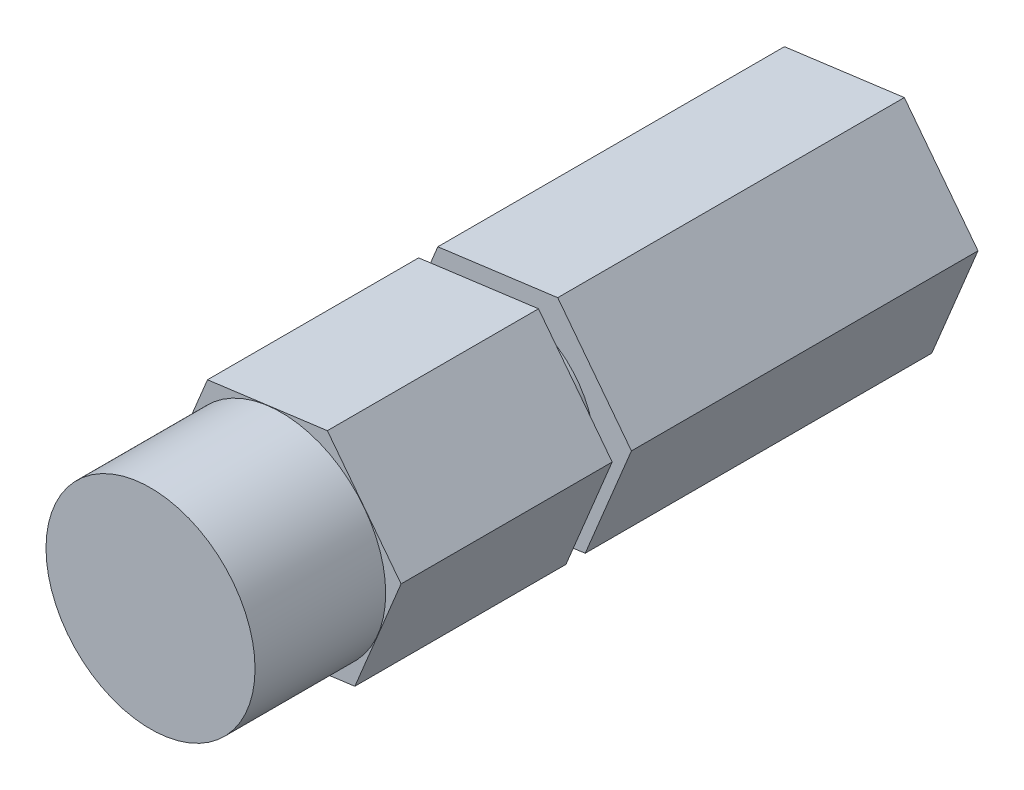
ISO-10303-21;
HEADER;
FILE_DESCRIPTION(('STEP AP214'),'2;1');
FILE_NAME('part.step','',(''),(''),'','','');
FILE_SCHEMA(('AUTOMOTIVE_DESIGN { 1 0 10303 214 1 1 1 1 }'));
ENDSEC;
DATA;
#1=APPLICATION_CONTEXT('core data for automotive mechanical design processes');
#2=APPLICATION_PROTOCOL_DEFINITION('international standard','automotive_design',2000,#1);
#3=PRODUCT_CONTEXT('',#1,'mechanical');
#4=PRODUCT('Part','Part','',(#3));
#5=PRODUCT_RELATED_PRODUCT_CATEGORY('part','',(#4));
#6=PRODUCT_DEFINITION_FORMATION('','',#4);
#7=PRODUCT_DEFINITION_CONTEXT('part definition',#1,'design');
#8=PRODUCT_DEFINITION('design','',#6,#7);
#9=PRODUCT_DEFINITION_SHAPE('','',#8);
#10=(LENGTH_UNIT() NAMED_UNIT(*) SI_UNIT(.MILLI.,.METRE.));
#11=(NAMED_UNIT(*) PLANE_ANGLE_UNIT() SI_UNIT($,.RADIAN.));
#12=(NAMED_UNIT(*) SI_UNIT($,.STERADIAN.) SOLID_ANGLE_UNIT());
#13=UNCERTAINTY_MEASURE_WITH_UNIT(LENGTH_MEASURE(1.E-05),#10,'distance_accuracy_value','');
#14=(GEOMETRIC_REPRESENTATION_CONTEXT(3) GLOBAL_UNCERTAINTY_ASSIGNED_CONTEXT((#13)) GLOBAL_UNIT_ASSIGNED_CONTEXT((#10,
#11,#12)) REPRESENTATION_CONTEXT('',''));
#15=CARTESIAN_POINT('',(0.,0.,0.));
#16=DIRECTION('',(0.,0.,1.));
#17=DIRECTION('',(1.,0.,0.));
#18=AXIS2_PLACEMENT_3D('',#15,#16,#17);
#19=CARTESIAN_POINT('',(7.28353005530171,0.963738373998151,-62.9041538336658));
#20=DIRECTION('',(0.79295528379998,0.609279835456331,0.));
#21=DIRECTION('',(-0.609279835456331,0.79295528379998,0.));
#22=AXIS2_PLACEMENT_3D('',#19,#20,#21);
#23=PLANE('',#22);
#24=DIRECTION('',(-0.609279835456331,0.79295528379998,0.));
#25=VECTOR('',#24,1.);
#26=CARTESIAN_POINT('',(7.28353005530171,0.963738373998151,-21.9329));
#27=LINE('',#26,#25);
#28=CARTESIAN_POINT('',(7.28353005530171,0.963738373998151,-21.9329));
#29=VERTEX_POINT('',#28);
#30=CARTESIAN_POINT('',(2.80714311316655,6.78959124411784,-21.9329));
#31=VERTEX_POINT('',#30);
#32=EDGE_CURVE('E56',#29,#31,#27,.T.);
#33=ORIENTED_EDGE('',*,*,#32,.F.);
#34=DIRECTION('',(0.,0.,1.));
#35=VECTOR('',#34,1.);
#36=CARTESIAN_POINT('',(7.28353005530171,0.963738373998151,-62.9041538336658));
#37=LINE('',#36,#35);
#38=CARTESIAN_POINT('',(7.28353005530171,0.963738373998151,-42.9895));
#39=VERTEX_POINT('',#38);
#40=EDGE_CURVE('E232',#39,#29,#37,.T.);
#41=ORIENTED_EDGE('',*,*,#40,.F.);
#42=DIRECTION('',(0.609279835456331,-0.79295528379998,0.));
#43=VECTOR('',#42,1.);
#44=CARTESIAN_POINT('',(7.28353005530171,0.963738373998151,-42.9895));
#45=LINE('',#44,#43);
#46=CARTESIAN_POINT('',(2.80714311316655,6.78959124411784,-42.9895));
#47=VERTEX_POINT('',#46);
#48=EDGE_CURVE('E186',#47,#39,#45,.T.);
#49=ORIENTED_EDGE('',*,*,#48,.F.);
#50=DIRECTION('',(0.,0.,1.));
#51=VECTOR('',#50,1.);
#52=CARTESIAN_POINT('',(2.80714311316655,6.78959124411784,-62.9041538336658));
#53=LINE('',#52,#51);
#54=EDGE_CURVE('E169',#47,#31,#53,.T.);
#55=ORIENTED_EDGE('',*,*,#54,.T.);
#56=EDGE_LOOP('',(#33,#41,#49,#55));
#57=FACE_BOUND('',#56,.T.);
#58=ADVANCED_FACE('F38',(#57),#23,.T.);
#59=CARTESIAN_POINT('',(4.47638694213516,-5.82585287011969,-62.9041538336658));
#60=DIRECTION('',(0.924129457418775,-0.382079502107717,0.));
#61=DIRECTION('',(0.382079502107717,0.924129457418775,0.));
#62=AXIS2_PLACEMENT_3D('',#59,#60,#61);
#63=PLANE('',#62);
#64=DIRECTION('',(0.382079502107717,0.924129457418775,0.));
#65=VECTOR('',#64,1.);
#66=CARTESIAN_POINT('',(4.47638694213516,-5.82585287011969,-21.9329));
#67=LINE('',#66,#65);
#68=CARTESIAN_POINT('',(4.47638694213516,-5.82585287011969,-21.9329));
#69=VERTEX_POINT('',#68);
#70=EDGE_CURVE('E460',#69,#29,#67,.T.);
#71=ORIENTED_EDGE('',*,*,#70,.F.);
#72=DIRECTION('',(0.,0.,1.));
#73=VECTOR('',#72,1.);
#74=CARTESIAN_POINT('',(4.47638694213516,-5.82585287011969,-62.9041538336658));
#75=LINE('',#74,#73);
#76=CARTESIAN_POINT('',(4.47638694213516,-5.82585287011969,-42.9895));
#77=VERTEX_POINT('',#76);
#78=EDGE_CURVE('E237',#77,#69,#75,.T.);
#79=ORIENTED_EDGE('',*,*,#78,.F.);
#80=DIRECTION('',(-0.382079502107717,-0.924129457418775,0.));
#81=VECTOR('',#80,1.);
#82=CARTESIAN_POINT('',(4.47638694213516,-5.82585287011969,-42.9895));
#83=LINE('',#82,#81);
#84=EDGE_CURVE('E473',#39,#77,#83,.T.);
#85=ORIENTED_EDGE('',*,*,#84,.F.);
#86=ORIENTED_EDGE('',*,*,#40,.T.);
#87=EDGE_LOOP('',(#71,#79,#85,#86));
#88=FACE_BOUND('',#87,.T.);
#89=ADVANCED_FACE('F282',(#88),#63,.T.);
#90=CARTESIAN_POINT('',(-2.80714311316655,-6.78959124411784,-62.9041538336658));
#91=DIRECTION('',(0.131174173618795,-0.991359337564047,0.));
#92=DIRECTION('',(0.991359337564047,0.131174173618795,0.));
#93=AXIS2_PLACEMENT_3D('',#90,#91,#92);
#94=PLANE('',#93);
#95=DIRECTION('',(0.991359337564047,0.131174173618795,0.));
#96=VECTOR('',#95,1.);
#97=CARTESIAN_POINT('',(-2.80714311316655,-6.78959124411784,-21.9329));
#98=LINE('',#97,#96);
#99=CARTESIAN_POINT('',(-2.80714311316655,-6.78959124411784,-21.9329));
#100=VERTEX_POINT('',#99);
#101=EDGE_CURVE('E456',#100,#69,#98,.T.);
#102=ORIENTED_EDGE('',*,*,#101,.F.);
#103=DIRECTION('',(0.,0.,1.));
#104=VECTOR('',#103,1.);
#105=CARTESIAN_POINT('',(-2.80714311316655,-6.78959124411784,-62.9041538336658));
#106=LINE('',#105,#104);
#107=CARTESIAN_POINT('',(-2.80714311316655,-6.78959124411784,-42.9895));
#108=VERTEX_POINT('',#107);
#109=EDGE_CURVE('E242',#108,#100,#106,.T.);
#110=ORIENTED_EDGE('',*,*,#109,.F.);
#111=DIRECTION('',(-0.991359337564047,-0.131174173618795,0.));
#112=VECTOR('',#111,1.);
#113=CARTESIAN_POINT('',(-2.80714311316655,-6.78959124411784,-42.9895));
#114=LINE('',#113,#112);
#115=EDGE_CURVE('E469',#77,#108,#114,.T.);
#116=ORIENTED_EDGE('',*,*,#115,.F.);
#117=ORIENTED_EDGE('',*,*,#78,.T.);
#118=EDGE_LOOP('',(#102,#110,#116,#117));
#119=FACE_BOUND('',#118,.T.);
#120=ADVANCED_FACE('F288',(#119),#94,.T.);
#121=CARTESIAN_POINT('',(-7.28353005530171,-0.963738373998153,-62.9041538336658));
#122=DIRECTION('',(-0.79295528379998,-0.609279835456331,0.));
#123=DIRECTION('',(0.609279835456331,-0.79295528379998,0.));
#124=AXIS2_PLACEMENT_3D('',#121,#122,#123);
#125=PLANE('',#124);
#126=DIRECTION('',(0.609279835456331,-0.79295528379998,0.));
#127=VECTOR('',#126,1.);
#128=CARTESIAN_POINT('',(-7.28353005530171,-0.963738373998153,-21.9329));
#129=LINE('',#128,#127);
#130=CARTESIAN_POINT('',(-7.28353005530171,-0.963738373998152,-21.9329));
#131=VERTEX_POINT('',#130);
#132=EDGE_CURVE('E461',#131,#100,#129,.T.);
#133=ORIENTED_EDGE('',*,*,#132,.F.);
#134=DIRECTION('',(0.,0.,1.));
#135=VECTOR('',#134,1.);
#136=CARTESIAN_POINT('',(-7.28353005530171,-0.963738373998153,-62.9041538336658));
#137=LINE('',#136,#135);
#138=CARTESIAN_POINT('',(-7.28353005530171,-0.963738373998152,-42.9895));
#139=VERTEX_POINT('',#138);
#140=EDGE_CURVE('E245',#139,#131,#137,.T.);
#141=ORIENTED_EDGE('',*,*,#140,.F.);
#142=DIRECTION('',(-0.609279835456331,0.79295528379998,0.));
#143=VECTOR('',#142,1.);
#144=CARTESIAN_POINT('',(-7.28353005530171,-0.963738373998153,-42.9895));
#145=LINE('',#144,#143);
#146=EDGE_CURVE('E465',#108,#139,#145,.T.);
#147=ORIENTED_EDGE('',*,*,#146,.F.);
#148=ORIENTED_EDGE('',*,*,#109,.T.);
#149=EDGE_LOOP('',(#133,#141,#147,#148));
#150=FACE_BOUND('',#149,.T.);
#151=ADVANCED_FACE('F277',(#150),#125,.T.);
#152=CARTESIAN_POINT('',(-4.47638694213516,5.82585287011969,-62.9041538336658));
#153=DIRECTION('',(-0.924129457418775,0.382079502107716,0.));
#154=DIRECTION('',(-0.382079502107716,-0.924129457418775,0.));
#155=AXIS2_PLACEMENT_3D('',#152,#153,#154);
#156=PLANE('',#155);
#157=DIRECTION('',(-0.382079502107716,-0.924129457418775,0.));
#158=VECTOR('',#157,1.);
#159=CARTESIAN_POINT('',(-4.47638694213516,5.82585287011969,-21.9329));
#160=LINE('',#159,#158);
#161=CARTESIAN_POINT('',(-4.47638694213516,5.82585287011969,-21.9329));
#162=VERTEX_POINT('',#161);
#163=EDGE_CURVE('E161',#162,#131,#160,.T.);
#164=ORIENTED_EDGE('',*,*,#163,.F.);
#165=DIRECTION('',(0.,0.,1.));
#166=VECTOR('',#165,1.);
#167=CARTESIAN_POINT('',(-4.47638694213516,5.82585287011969,-62.9041538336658));
#168=LINE('',#167,#166);
#169=CARTESIAN_POINT('',(-4.47638694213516,5.82585287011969,-42.9895));
#170=VERTEX_POINT('',#169);
#171=EDGE_CURVE('E181',#170,#162,#168,.T.);
#172=ORIENTED_EDGE('',*,*,#171,.F.);
#173=DIRECTION('',(0.382079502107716,0.924129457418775,0.));
#174=VECTOR('',#173,1.);
#175=CARTESIAN_POINT('',(-4.47638694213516,5.82585287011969,-42.9895));
#176=LINE('',#175,#174);
#177=EDGE_CURVE('E236',#139,#170,#176,.T.);
#178=ORIENTED_EDGE('',*,*,#177,.F.);
#179=ORIENTED_EDGE('',*,*,#140,.T.);
#180=EDGE_LOOP('',(#164,#172,#178,#179));
#181=FACE_BOUND('',#180,.T.);
#182=ADVANCED_FACE('F269',(#181),#156,.T.);
#183=CARTESIAN_POINT('',(2.80714311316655,6.78959124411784,-62.9041538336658));
#184=DIRECTION('',(-0.131174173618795,0.991359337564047,0.));
#185=DIRECTION('',(-0.991359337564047,-0.131174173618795,0.));
#186=AXIS2_PLACEMENT_3D('',#183,#184,#185);
#187=PLANE('',#186);
#188=DIRECTION('',(-0.991359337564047,-0.131174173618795,0.));
#189=VECTOR('',#188,1.);
#190=CARTESIAN_POINT('',(2.80714311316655,6.78959124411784,-21.9329));
#191=LINE('',#190,#189);
#192=EDGE_CURVE('E11',#31,#162,#191,.T.);
#193=ORIENTED_EDGE('',*,*,#192,.F.);
#194=ORIENTED_EDGE('',*,*,#54,.F.);
#195=DIRECTION('',(0.991359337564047,0.131174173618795,0.));
#196=VECTOR('',#195,1.);
#197=CARTESIAN_POINT('',(2.80714311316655,6.78959124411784,-42.9895));
#198=LINE('',#197,#196);
#199=EDGE_CURVE('E183',#170,#47,#198,.T.);
#200=ORIENTED_EDGE('',*,*,#199,.F.);
#201=ORIENTED_EDGE('',*,*,#171,.T.);
#202=EDGE_LOOP('',(#193,#194,#200,#201));
#203=FACE_BOUND('',#202,.T.);
#204=ADVANCED_FACE('F279',(#203),#187,.T.);
#205=CARTESIAN_POINT('',(0.,6.3627,-42.9895));
#206=DIRECTION('',(0.,0.,1.));
#207=DIRECTION('',(1.,0.,0.));
#208=AXIS2_PLACEMENT_3D('',#205,#206,#207);
#209=PLANE('',#208);
#210=CARTESIAN_POINT('',(0.,0.,-42.9895));
#211=DIRECTION('',(0.,0.,-1.));
#212=DIRECTION('',(-1.,0.,0.));
#213=AXIS2_PLACEMENT_3D('',#210,#211,#212);
#214=CIRCLE('',#213,2.01929999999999);
#215=CARTESIAN_POINT('',(-2.01929999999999,0.,-42.9895));
#216=VERTEX_POINT('',#215);
#217=EDGE_CURVE('E219',#216,#216,#214,.T.);
#218=ORIENTED_EDGE('',*,*,#217,.F.);
#219=EDGE_LOOP('',(#218));
#220=FACE_BOUND('',#219,.T.);
#221=ORIENTED_EDGE('',*,*,#177,.T.);
#222=ORIENTED_EDGE('',*,*,#199,.T.);
#223=ORIENTED_EDGE('',*,*,#48,.T.);
#224=ORIENTED_EDGE('',*,*,#84,.T.);
#225=ORIENTED_EDGE('',*,*,#115,.T.);
#226=ORIENTED_EDGE('',*,*,#146,.T.);
#227=EDGE_LOOP('',(#221,#222,#223,#224,#225,#226));
#228=FACE_BOUND('',#227,.T.);
#229=ADVANCED_FACE('F307',(#220,#228),#209,.F.);
#230=CARTESIAN_POINT('',(0.,0.,-30.2895));
#231=DIRECTION('',(0.,0.,-1.));
#232=DIRECTION('',(-1.,0.,0.));
#233=AXIS2_PLACEMENT_3D('',#230,#231,#232);
#234=CONICAL_SURFACE('',#233,2.0193,1.02974425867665);
#235=CARTESIAN_POINT('',(0.,0.,-29.0761821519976));
#236=VERTEX_POINT('',#235);
#237=VERTEX_LOOP('',#236);
#238=FACE_BOUND('',#237,.T.);
#239=CARTESIAN_POINT('',(0.,0.,-30.2895));
#240=DIRECTION('',(0.,0.,-1.));
#241=DIRECTION('',(-1.,0.,0.));
#242=AXIS2_PLACEMENT_3D('',#239,#240,#241);
#243=CIRCLE('',#242,2.0193);
#244=CARTESIAN_POINT('',(-2.0193,0.,-30.2895));
#245=VERTEX_POINT('',#244);
#246=EDGE_CURVE('E212',#245,#245,#243,.T.);
#247=ORIENTED_EDGE('',*,*,#246,.T.);
#248=EDGE_LOOP('',(#247));
#249=FACE_BOUND('',#248,.T.);
#250=ADVANCED_FACE('F303',(#238,#249),#234,.F.);
#251=CARTESIAN_POINT('',(0.,0.,-42.9895));
#252=DIRECTION('',(0.,0.,-1.));
#253=DIRECTION('',(-1.,0.,0.));
#254=AXIS2_PLACEMENT_3D('',#251,#252,#253);
#255=CYLINDRICAL_SURFACE('',#254,2.01929999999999);
#256=ORIENTED_EDGE('',*,*,#246,.F.);
#257=EDGE_LOOP('',(#256));
#258=FACE_BOUND('',#257,.T.);
#259=ORIENTED_EDGE('',*,*,#217,.T.);
#260=EDGE_LOOP('',(#259));
#261=FACE_BOUND('',#260,.T.);
#262=ADVANCED_FACE('F306',(#258,#261),#255,.F.);
#263=CARTESIAN_POINT('',(9.38506380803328,0.,-21.9329));
#264=DIRECTION('',(0.,0.,-1.));
#265=DIRECTION('',(-1.,0.,0.));
#266=AXIS2_PLACEMENT_3D('',#263,#264,#265);
#267=PLANE('',#266);
#268=ORIENTED_EDGE('',*,*,#32,.T.);
#269=ORIENTED_EDGE('',*,*,#192,.T.);
#270=ORIENTED_EDGE('',*,*,#163,.T.);
#271=ORIENTED_EDGE('',*,*,#132,.T.);
#272=ORIENTED_EDGE('',*,*,#101,.T.);
#273=ORIENTED_EDGE('',*,*,#70,.T.);
#274=EDGE_LOOP('',(#268,#269,#270,#271,#272,#273));
#275=FACE_BOUND('',#274,.T.);
#276=CARTESIAN_POINT('',(0.,0.,-21.9329));
#277=DIRECTION('',(0.,0.,1.));
#278=DIRECTION('',(1.,0.,0.));
#279=AXIS2_PLACEMENT_3D('',#276,#277,#278);
#280=CIRCLE('',#279,5.0292);
#281=CARTESIAN_POINT('',(5.0292,0.,-21.9329));
#282=VERTEX_POINT('',#281);
#283=EDGE_CURVE('E495',#282,#282,#280,.T.);
#284=ORIENTED_EDGE('',*,*,#283,.F.);
#285=EDGE_LOOP('',(#284));
#286=FACE_BOUND('',#285,.T.);
#287=ADVANCED_FACE('F311',(#275,#286),#267,.F.);
#288=CARTESIAN_POINT('',(0.,0.,0.));
#289=DIRECTION('',(0.,0.,1.));
#290=DIRECTION('',(1.,0.,0.));
#291=AXIS2_PLACEMENT_3D('',#288,#289,#290);
#292=CYLINDRICAL_SURFACE('',#291,5.0292);
#293=CARTESIAN_POINT('',(0.,0.,-20.7645));
#294=DIRECTION('',(0.,0.,1.));
#295=DIRECTION('',(1.,0.,0.));
#296=AXIS2_PLACEMENT_3D('',#293,#294,#295);
#297=CIRCLE('',#296,5.0292);
#298=CARTESIAN_POINT('',(5.0292,0.,-20.7645));
#299=VERTEX_POINT('',#298);
#300=EDGE_CURVE('E498',#299,#299,#297,.T.);
#301=ORIENTED_EDGE('',*,*,#300,.F.);
#302=EDGE_LOOP('',(#301));
#303=FACE_BOUND('',#302,.T.);
#304=ORIENTED_EDGE('',*,*,#283,.T.);
#305=EDGE_LOOP('',(#304));
#306=FACE_BOUND('',#305,.T.);
#307=ADVANCED_FACE('F315',(#303,#306),#292,.T.);
#308=CARTESIAN_POINT('',(9.38506380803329,0.,-20.7645));
#309=DIRECTION('',(0.,0.,1.));
#310=DIRECTION('',(1.,0.,0.));
#311=AXIS2_PLACEMENT_3D('',#308,#309,#310);
#312=PLANE('',#311);
#313=DIRECTION('',(0.609279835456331,-0.79295528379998,0.));
#314=VECTOR('',#313,1.);
#315=CARTESIAN_POINT('',(7.28353005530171,0.963738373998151,-20.7645));
#316=LINE('',#315,#314);
#317=CARTESIAN_POINT('',(2.80714311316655,6.78959124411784,-20.7645));
#318=VERTEX_POINT('',#317);
#319=CARTESIAN_POINT('',(7.28353005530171,0.963738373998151,-20.7645));
#320=VERTEX_POINT('',#319);
#321=EDGE_CURVE('E146',#318,#320,#316,.T.);
#322=ORIENTED_EDGE('',*,*,#321,.T.);
#323=DIRECTION('',(-0.382079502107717,-0.924129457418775,0.));
#324=VECTOR('',#323,1.);
#325=CARTESIAN_POINT('',(4.47638694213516,-5.82585287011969,-20.7645));
#326=LINE('',#325,#324);
#327=CARTESIAN_POINT('',(4.47638694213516,-5.82585287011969,-20.7645));
#328=VERTEX_POINT('',#327);
#329=EDGE_CURVE('E162',#320,#328,#326,.T.);
#330=ORIENTED_EDGE('',*,*,#329,.T.);
#331=DIRECTION('',(-0.991359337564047,-0.131174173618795,0.));
#332=VECTOR('',#331,1.);
#333=CARTESIAN_POINT('',(-2.80714311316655,-6.78959124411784,-20.7645));
#334=LINE('',#333,#332);
#335=CARTESIAN_POINT('',(-2.80714311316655,-6.78959124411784,-20.7645));
#336=VERTEX_POINT('',#335);
#337=EDGE_CURVE('E489',#328,#336,#334,.T.);
#338=ORIENTED_EDGE('',*,*,#337,.T.);
#339=DIRECTION('',(-0.609279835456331,0.79295528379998,0.));
#340=VECTOR('',#339,1.);
#341=CARTESIAN_POINT('',(-7.28353005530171,-0.963738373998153,-20.7645));
#342=LINE('',#341,#340);
#343=CARTESIAN_POINT('',(-7.28353005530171,-0.963738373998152,-20.7645));
#344=VERTEX_POINT('',#343);
#345=EDGE_CURVE('E492',#336,#344,#342,.T.);
#346=ORIENTED_EDGE('',*,*,#345,.T.);
#347=DIRECTION('',(0.382079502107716,0.924129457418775,0.));
#348=VECTOR('',#347,1.);
#349=CARTESIAN_POINT('',(-4.47638694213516,5.82585287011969,-20.7645));
#350=LINE('',#349,#348);
#351=CARTESIAN_POINT('',(-4.47638694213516,5.82585287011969,-20.7645));
#352=VERTEX_POINT('',#351);
#353=EDGE_CURVE('E67',#344,#352,#350,.T.);
#354=ORIENTED_EDGE('',*,*,#353,.T.);
#355=DIRECTION('',(0.991359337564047,0.131174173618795,0.));
#356=VECTOR('',#355,1.);
#357=CARTESIAN_POINT('',(2.80714311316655,6.78959124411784,-20.7645));
#358=LINE('',#357,#356);
#359=EDGE_CURVE('E47',#352,#318,#358,.T.);
#360=ORIENTED_EDGE('',*,*,#359,.T.);
#361=EDGE_LOOP('',(#322,#330,#338,#346,#354,#360));
#362=FACE_BOUND('',#361,.T.);
#363=ORIENTED_EDGE('',*,*,#300,.T.);
#364=EDGE_LOOP('',(#363));
#365=FACE_BOUND('',#364,.T.);
#366=ADVANCED_FACE('F144',(#362,#365),#312,.F.);
#367=CARTESIAN_POINT('',(0.,0.,0.));
#368=DIRECTION('',(0.,0.,-1.));
#369=DIRECTION('',(-1.,0.,0.));
#370=AXIS2_PLACEMENT_3D('',#367,#368,#369);
#371=PLANE('',#370);
#372=CARTESIAN_POINT('',(0.,0.,0.));
#373=DIRECTION('',(0.,0.,1.));
#374=DIRECTION('',(1.,0.,0.));
#375=AXIS2_PLACEMENT_3D('',#372,#373,#374);
#376=CIRCLE('',#375,6.35);
#377=CARTESIAN_POINT('',(6.35,0.,0.));
#378=VERTEX_POINT('',#377);
#379=EDGE_CURVE('E152',#378,#378,#376,.T.);
#380=ORIENTED_EDGE('',*,*,#379,.T.);
#381=EDGE_LOOP('',(#380));
#382=FACE_BOUND('',#381,.T.);
#383=ADVANCED_FACE('F40',(#382),#371,.F.);
#384=CARTESIAN_POINT('',(0.,0.,0.));
#385=DIRECTION('',(0.,0.,1.));
#386=DIRECTION('',(1.,0.,0.));
#387=AXIS2_PLACEMENT_3D('',#384,#385,#386);
#388=CYLINDRICAL_SURFACE('',#387,6.35);
#389=ORIENTED_EDGE('',*,*,#379,.F.);
#390=EDGE_LOOP('',(#389));
#391=FACE_BOUND('',#390,.T.);
#392=CARTESIAN_POINT('',(0.,0.,-7.9375));
#393=DIRECTION('',(0.,0.,1.));
#394=DIRECTION('',(1.,0.,0.));
#395=AXIS2_PLACEMENT_3D('',#392,#393,#394);
#396=CIRCLE('',#395,6.35);
#397=CARTESIAN_POINT('',(6.35,0.,-7.9375));
#398=VERTEX_POINT('',#397);
#399=EDGE_CURVE('E185',#398,#398,#396,.T.);
#400=ORIENTED_EDGE('',*,*,#399,.T.);
#401=EDGE_LOOP('',(#400));
#402=FACE_BOUND('',#401,.T.);
#403=ADVANCED_FACE('F196',(#391,#402),#388,.T.);
#404=CARTESIAN_POINT('',(0.,6.35,-7.9375));
#405=DIRECTION('',(0.,0.,-1.));
#406=DIRECTION('',(-1.,0.,0.));
#407=AXIS2_PLACEMENT_3D('',#404,#405,#406);
#408=PLANE('',#407);
#409=ORIENTED_EDGE('',*,*,#399,.F.);
#410=EDGE_LOOP('',(#409));
#411=FACE_BOUND('',#410,.T.);
#412=DIRECTION('',(0.382079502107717,0.924129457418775,0.));
#413=VECTOR('',#412,1.);
#414=CARTESIAN_POINT('',(4.47638694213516,-5.82585287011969,-7.9375));
#415=LINE('',#414,#413);
#416=CARTESIAN_POINT('',(4.47638694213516,-5.82585287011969,-7.9375));
#417=VERTEX_POINT('',#416);
#418=CARTESIAN_POINT('',(7.28353005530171,0.963738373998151,-7.9375));
#419=VERTEX_POINT('',#418);
#420=EDGE_CURVE('E170',#417,#419,#415,.T.);
#421=ORIENTED_EDGE('',*,*,#420,.T.);
#422=DIRECTION('',(-0.609279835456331,0.79295528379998,0.));
#423=VECTOR('',#422,1.);
#424=CARTESIAN_POINT('',(7.28353005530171,0.963738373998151,-7.9375));
#425=LINE('',#424,#423);
#426=CARTESIAN_POINT('',(2.80714311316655,6.78959124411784,-7.9375));
#427=VERTEX_POINT('',#426);
#428=EDGE_CURVE('E207',#419,#427,#425,.T.);
#429=ORIENTED_EDGE('',*,*,#428,.T.);
#430=DIRECTION('',(-0.991359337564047,-0.131174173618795,0.));
#431=VECTOR('',#430,1.);
#432=CARTESIAN_POINT('',(2.80714311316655,6.78959124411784,-7.9375));
#433=LINE('',#432,#431);
#434=CARTESIAN_POINT('',(-4.47638694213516,5.82585287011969,-7.9375));
#435=VERTEX_POINT('',#434);
#436=EDGE_CURVE('E167',#427,#435,#433,.T.);
#437=ORIENTED_EDGE('',*,*,#436,.T.);
#438=DIRECTION('',(-0.382079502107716,-0.924129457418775,0.));
#439=VECTOR('',#438,1.);
#440=CARTESIAN_POINT('',(-4.47638694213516,5.82585287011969,-7.9375));
#441=LINE('',#440,#439);
#442=CARTESIAN_POINT('',(-7.28353005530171,-0.963738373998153,-7.9375));
#443=VERTEX_POINT('',#442);
#444=EDGE_CURVE('E215',#435,#443,#441,.T.);
#445=ORIENTED_EDGE('',*,*,#444,.T.);
#446=DIRECTION('',(0.609279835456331,-0.79295528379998,0.));
#447=VECTOR('',#446,1.);
#448=CARTESIAN_POINT('',(-7.28353005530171,-0.963738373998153,-7.9375));
#449=LINE('',#448,#447);
#450=CARTESIAN_POINT('',(-2.80714311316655,-6.78959124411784,-7.9375));
#451=VERTEX_POINT('',#450);
#452=EDGE_CURVE('E227',#443,#451,#449,.T.);
#453=ORIENTED_EDGE('',*,*,#452,.T.);
#454=DIRECTION('',(0.991359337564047,0.131174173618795,0.));
#455=VECTOR('',#454,1.);
#456=CARTESIAN_POINT('',(-2.80714311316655,-6.78959124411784,-7.9375));
#457=LINE('',#456,#455);
#458=EDGE_CURVE('E177',#451,#417,#457,.T.);
#459=ORIENTED_EDGE('',*,*,#458,.T.);
#460=EDGE_LOOP('',(#421,#429,#437,#445,#453,#459));
#461=FACE_BOUND('',#460,.T.);
#462=ADVANCED_FACE('F199',(#411,#461),#408,.F.);
#463=ORIENTED_EDGE('',*,*,#359,.F.);
#464=EDGE_CURVE('E175',#352,#435,#168,.T.);
#465=ORIENTED_EDGE('',*,*,#464,.T.);
#466=ORIENTED_EDGE('',*,*,#436,.F.);
#467=EDGE_CURVE('E157',#318,#427,#53,.T.);
#468=ORIENTED_EDGE('',*,*,#467,.F.);
#469=EDGE_LOOP('',(#463,#465,#466,#468));
#470=FACE_BOUND('',#469,.T.);
#471=ADVANCED_FACE('F165',(#470),#187,.T.);
#472=ORIENTED_EDGE('',*,*,#353,.F.);
#473=EDGE_CURVE('E248',#344,#443,#137,.T.);
#474=ORIENTED_EDGE('',*,*,#473,.T.);
#475=ORIENTED_EDGE('',*,*,#444,.F.);
#476=ORIENTED_EDGE('',*,*,#464,.F.);
#477=EDGE_LOOP('',(#472,#474,#475,#476));
#478=FACE_BOUND('',#477,.T.);
#479=ADVANCED_FACE('F265',(#478),#156,.T.);
#480=ORIENTED_EDGE('',*,*,#345,.F.);
#481=EDGE_CURVE('E244',#336,#451,#106,.T.);
#482=ORIENTED_EDGE('',*,*,#481,.T.);
#483=ORIENTED_EDGE('',*,*,#452,.F.);
#484=ORIENTED_EDGE('',*,*,#473,.F.);
#485=EDGE_LOOP('',(#480,#482,#483,#484));
#486=FACE_BOUND('',#485,.T.);
#487=ADVANCED_FACE('F267',(#486),#125,.T.);
#488=ORIENTED_EDGE('',*,*,#337,.F.);
#489=EDGE_CURVE('E241',#328,#417,#75,.T.);
#490=ORIENTED_EDGE('',*,*,#489,.T.);
#491=ORIENTED_EDGE('',*,*,#458,.F.);
#492=ORIENTED_EDGE('',*,*,#481,.F.);
#493=EDGE_LOOP('',(#488,#490,#491,#492));
#494=FACE_BOUND('',#493,.T.);
#495=ADVANCED_FACE('F274',(#494),#94,.T.);
#496=ORIENTED_EDGE('',*,*,#329,.F.);
#497=EDGE_CURVE('E159',#320,#419,#37,.T.);
#498=ORIENTED_EDGE('',*,*,#497,.T.);
#499=ORIENTED_EDGE('',*,*,#420,.F.);
#500=ORIENTED_EDGE('',*,*,#489,.F.);
#501=EDGE_LOOP('',(#496,#498,#499,#500));
#502=FACE_BOUND('',#501,.T.);
#503=ADVANCED_FACE('F291',(#502),#63,.T.);
#504=ORIENTED_EDGE('',*,*,#321,.F.);
#505=ORIENTED_EDGE('',*,*,#467,.T.);
#506=ORIENTED_EDGE('',*,*,#428,.F.);
#507=ORIENTED_EDGE('',*,*,#497,.F.);
#508=EDGE_LOOP('',(#504,#505,#506,#507));
#509=FACE_BOUND('',#508,.T.);
#510=ADVANCED_FACE('F155',(#509),#23,.T.);
#511=CLOSED_SHELL('',(#58,#89,#120,#151,#182,#204,#229,#250,#262,#287,#307,#366,#383,#403,#462,
#471,#479,#487,#495,#503,#510));
#512=MANIFOLD_SOLID_BREP('B2',#511);
#513=ADVANCED_BREP_SHAPE_REPRESENTATION('',(#18,#512),#14);
#514=SHAPE_DEFINITION_REPRESENTATION(#9,#513);
ENDSEC;
END-ISO-10303-21;
